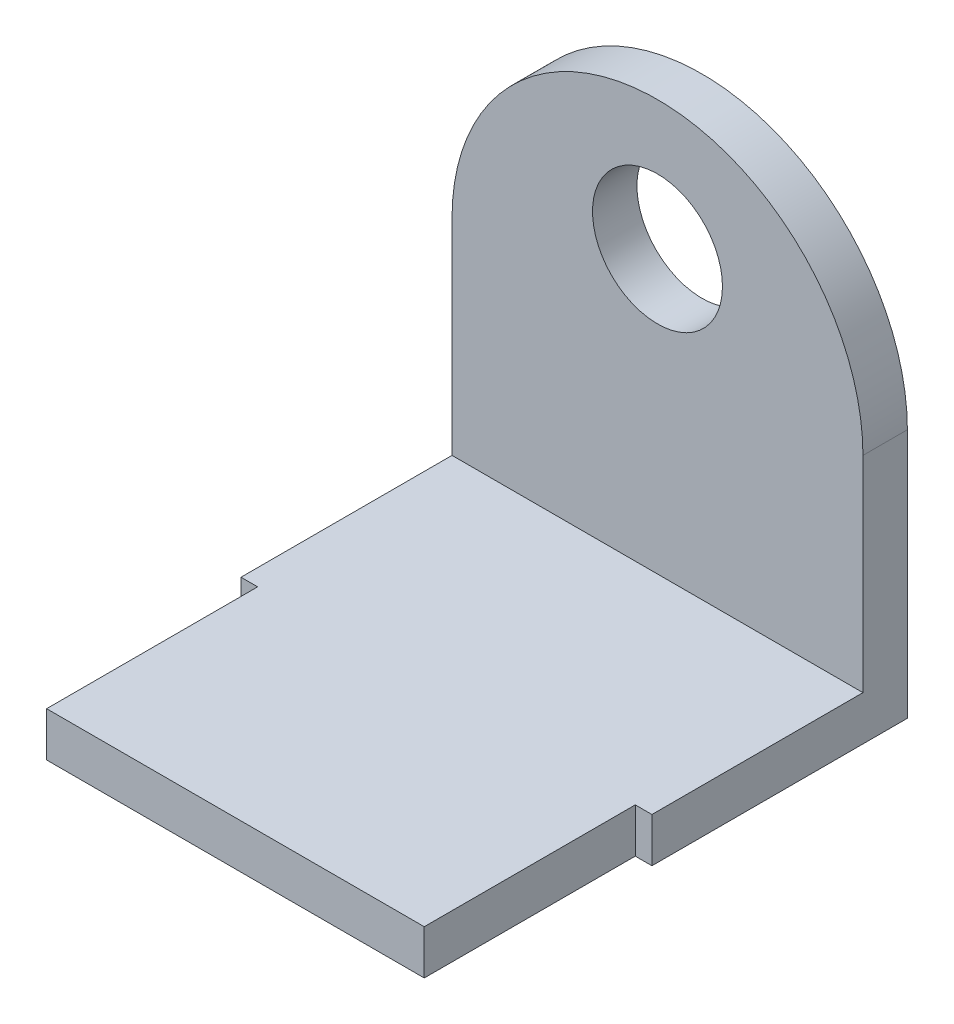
ISO-10303-21;
HEADER;
FILE_DESCRIPTION(('STEP AP214'),'2;1');
FILE_NAME('part.step','',(''),(''),'','','');
FILE_SCHEMA(('AUTOMOTIVE_DESIGN { 1 0 10303 214 1 1 1 1 }'));
ENDSEC;
DATA;
#1=APPLICATION_CONTEXT('core data for automotive mechanical design processes');
#2=APPLICATION_PROTOCOL_DEFINITION('international standard','automotive_design',2000,#1);
#3=PRODUCT_CONTEXT('',#1,'mechanical');
#4=PRODUCT('Part','Part','',(#3));
#5=PRODUCT_RELATED_PRODUCT_CATEGORY('part','',(#4));
#6=PRODUCT_DEFINITION_FORMATION('','',#4);
#7=PRODUCT_DEFINITION_CONTEXT('part definition',#1,'design');
#8=PRODUCT_DEFINITION('design','',#6,#7);
#9=PRODUCT_DEFINITION_SHAPE('','',#8);
#10=(LENGTH_UNIT() NAMED_UNIT(*) SI_UNIT(.MILLI.,.METRE.));
#11=(NAMED_UNIT(*) PLANE_ANGLE_UNIT() SI_UNIT($,.RADIAN.));
#12=(NAMED_UNIT(*) SI_UNIT($,.STERADIAN.) SOLID_ANGLE_UNIT());
#13=UNCERTAINTY_MEASURE_WITH_UNIT(LENGTH_MEASURE(1.E-05),#10,'distance_accuracy_value','');
#14=(GEOMETRIC_REPRESENTATION_CONTEXT(3) GLOBAL_UNCERTAINTY_ASSIGNED_CONTEXT((#13)) GLOBAL_UNIT_ASSIGNED_CONTEXT((#10,
#11,#12)) REPRESENTATION_CONTEXT('',''));
#15=CARTESIAN_POINT('',(0.,0.,0.));
#16=DIRECTION('',(0.,0.,1.));
#17=DIRECTION('',(1.,0.,0.));
#18=AXIS2_PLACEMENT_3D('',#15,#16,#17);
#19=CARTESIAN_POINT('',(-46.1103954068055,-22.5,4.));
#20=DIRECTION('',(0.,1.,0.));
#21=DIRECTION('',(-1.,0.,0.));
#22=AXIS2_PLACEMENT_3D('',#19,#20,#21);
#23=PLANE('',#22);
#24=DIRECTION('',(0.,0.,1.));
#25=VECTOR('',#24,1.);
#26=CARTESIAN_POINT('',(-44.6103954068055,-22.5,4.));
#27=LINE('',#26,#25);
#28=CARTESIAN_POINT('',(-44.6103954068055,-22.5,23.));
#29=VERTEX_POINT('',#28);
#30=CARTESIAN_POINT('',(-44.6103954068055,-22.5,42.));
#31=VERTEX_POINT('',#30);
#32=EDGE_CURVE('E47',#29,#31,#27,.T.);
#33=ORIENTED_EDGE('',*,*,#32,.F.);
#34=DIRECTION('',(-1.,0.,0.));
#35=VECTOR('',#34,1.);
#36=CARTESIAN_POINT('',(-46.1103954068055,-22.5,23.));
#37=LINE('',#36,#35);
#38=CARTESIAN_POINT('',(-46.1103954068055,-22.5,23.));
#39=VERTEX_POINT('',#38);
#40=EDGE_CURVE('E116',#29,#39,#37,.T.);
#41=ORIENTED_EDGE('',*,*,#40,.T.);
#42=DIRECTION('',(0.,0.,-1.));
#43=VECTOR('',#42,1.);
#44=CARTESIAN_POINT('',(-46.1103954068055,-22.5,4.));
#45=LINE('',#44,#43);
#46=CARTESIAN_POINT('',(-46.1103954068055,-22.5,0.));
#47=VERTEX_POINT('',#46);
#48=EDGE_CURVE('E188',#39,#47,#45,.T.);
#49=ORIENTED_EDGE('',*,*,#48,.T.);
#50=DIRECTION('',(1.,0.,0.));
#51=VECTOR('',#50,1.);
#52=CARTESIAN_POINT('',(-46.1103954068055,-22.5,0.));
#53=LINE('',#52,#51);
#54=CARTESIAN_POINT('',(-9.11039540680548,-22.5,0.));
#55=VERTEX_POINT('',#54);
#56=EDGE_CURVE('E180',#47,#55,#53,.T.);
#57=ORIENTED_EDGE('',*,*,#56,.T.);
#58=DIRECTION('',(0.,0.,-1.));
#59=VECTOR('',#58,1.);
#60=CARTESIAN_POINT('',(-9.11039540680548,-22.5,4.));
#61=LINE('',#60,#59);
#62=CARTESIAN_POINT('',(-9.11039540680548,-22.5,23.));
#63=VERTEX_POINT('',#62);
#64=EDGE_CURVE('E186',#63,#55,#61,.T.);
#65=ORIENTED_EDGE('',*,*,#64,.F.);
#66=DIRECTION('',(1.,0.,0.));
#67=VECTOR('',#66,1.);
#68=CARTESIAN_POINT('',(-46.1103954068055,-22.5,23.));
#69=LINE('',#68,#67);
#70=CARTESIAN_POINT('',(-10.6103954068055,-22.5,23.));
#71=VERTEX_POINT('',#70);
#72=EDGE_CURVE('E146',#71,#63,#69,.T.);
#73=ORIENTED_EDGE('',*,*,#72,.F.);
#74=DIRECTION('',(0.,0.,1.));
#75=VECTOR('',#74,1.);
#76=CARTESIAN_POINT('',(-10.6103954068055,-22.5,4.));
#77=LINE('',#76,#75);
#78=CARTESIAN_POINT('',(-10.6103954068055,-22.5,42.));
#79=VERTEX_POINT('',#78);
#80=EDGE_CURVE('E142',#71,#79,#77,.T.);
#81=ORIENTED_EDGE('',*,*,#80,.T.);
#82=DIRECTION('',(1.,0.,0.));
#83=VECTOR('',#82,1.);
#84=CARTESIAN_POINT('',(-46.1103954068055,-22.5,42.));
#85=LINE('',#84,#83);
#86=EDGE_CURVE('E148',#31,#79,#85,.T.);
#87=ORIENTED_EDGE('',*,*,#86,.F.);
#88=EDGE_LOOP('',(#33,#41,#49,#57,#65,#73,#81,#87));
#89=FACE_BOUND('',#88,.T.);
#90=ADVANCED_FACE('F33',(#89),#23,.F.);
#91=CARTESIAN_POINT('',(-46.1103954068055,-18.5,42.));
#92=DIRECTION('',(0.,-1.,0.));
#93=DIRECTION('',(0.,0.,-1.));
#94=AXIS2_PLACEMENT_3D('',#91,#92,#93);
#95=PLANE('',#94);
#96=DIRECTION('',(0.,0.,1.));
#97=VECTOR('',#96,1.);
#98=CARTESIAN_POINT('',(-44.6103954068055,-18.5,0.));
#99=LINE('',#98,#97);
#100=CARTESIAN_POINT('',(-44.6103954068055,-18.5,23.));
#101=VERTEX_POINT('',#100);
#102=CARTESIAN_POINT('',(-44.6103954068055,-18.5,42.));
#103=VERTEX_POINT('',#102);
#104=EDGE_CURVE('E120',#101,#103,#99,.T.);
#105=ORIENTED_EDGE('',*,*,#104,.T.);
#106=DIRECTION('',(-1.,0.,0.));
#107=VECTOR('',#106,1.);
#108=CARTESIAN_POINT('',(-46.1103954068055,-18.5,42.));
#109=LINE('',#108,#107);
#110=CARTESIAN_POINT('',(-10.6103954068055,-18.5,42.));
#111=VERTEX_POINT('',#110);
#112=EDGE_CURVE('E150',#111,#103,#109,.T.);
#113=ORIENTED_EDGE('',*,*,#112,.F.);
#114=DIRECTION('',(0.,0.,1.));
#115=VECTOR('',#114,1.);
#116=CARTESIAN_POINT('',(-10.6103954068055,-18.5,0.));
#117=LINE('',#116,#115);
#118=CARTESIAN_POINT('',(-10.6103954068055,-18.5,23.));
#119=VERTEX_POINT('',#118);
#120=EDGE_CURVE('E55',#119,#111,#117,.T.);
#121=ORIENTED_EDGE('',*,*,#120,.F.);
#122=DIRECTION('',(1.,0.,0.));
#123=VECTOR('',#122,1.);
#124=CARTESIAN_POINT('',(0.,-18.5,23.));
#125=LINE('',#124,#123);
#126=CARTESIAN_POINT('',(-9.11039540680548,-18.5,23.));
#127=VERTEX_POINT('',#126);
#128=EDGE_CURVE('E135',#119,#127,#125,.T.);
#129=ORIENTED_EDGE('',*,*,#128,.T.);
#130=DIRECTION('',(0.,0.,-1.));
#131=VECTOR('',#130,1.);
#132=CARTESIAN_POINT('',(-9.11039540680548,-18.5,42.));
#133=LINE('',#132,#131);
#134=CARTESIAN_POINT('',(-9.11039540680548,-18.5,4.));
#135=VERTEX_POINT('',#134);
#136=EDGE_CURVE('E153',#127,#135,#133,.T.);
#137=ORIENTED_EDGE('',*,*,#136,.T.);
#138=DIRECTION('',(1.,0.,0.));
#139=VECTOR('',#138,1.);
#140=CARTESIAN_POINT('',(-27.6103954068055,-18.5,4.));
#141=LINE('',#140,#139);
#142=CARTESIAN_POINT('',(-46.1103954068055,-18.5,4.00000000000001));
#143=VERTEX_POINT('',#142);
#144=EDGE_CURVE('E155',#143,#135,#141,.T.);
#145=ORIENTED_EDGE('',*,*,#144,.F.);
#146=DIRECTION('',(0.,0.,-1.));
#147=VECTOR('',#146,1.);
#148=CARTESIAN_POINT('',(-46.1103954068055,-18.5,42.));
#149=LINE('',#148,#147);
#150=CARTESIAN_POINT('',(-46.1103954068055,-18.5,23.));
#151=VERTEX_POINT('',#150);
#152=EDGE_CURVE('E129',#151,#143,#149,.T.);
#153=ORIENTED_EDGE('',*,*,#152,.F.);
#154=DIRECTION('',(-1.,0.,0.));
#155=VECTOR('',#154,1.);
#156=CARTESIAN_POINT('',(0.,-18.5,22.9999999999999));
#157=LINE('',#156,#155);
#158=EDGE_CURVE('E113',#101,#151,#157,.T.);
#159=ORIENTED_EDGE('',*,*,#158,.F.);
#160=EDGE_LOOP('',(#105,#113,#121,#129,#137,#145,#153,#159));
#161=FACE_BOUND('',#160,.T.);
#162=ADVANCED_FACE('F127',(#161),#95,.F.);
#163=CARTESIAN_POINT('',(0.,0.,42.));
#164=DIRECTION('',(0.,0.,-1.));
#165=DIRECTION('',(-1.,0.,0.));
#166=AXIS2_PLACEMENT_3D('',#163,#164,#165);
#167=PLANE('',#166);
#168=DIRECTION('',(0.,1.,0.));
#169=VECTOR('',#168,1.);
#170=CARTESIAN_POINT('',(-44.6103954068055,0.,42.));
#171=LINE('',#170,#169);
#172=EDGE_CURVE('E11',#31,#103,#171,.T.);
#173=ORIENTED_EDGE('',*,*,#172,.F.);
#174=ORIENTED_EDGE('',*,*,#86,.T.);
#175=DIRECTION('',(0.,1.,0.));
#176=VECTOR('',#175,1.);
#177=CARTESIAN_POINT('',(-10.6103954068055,0.,42.));
#178=LINE('',#177,#176);
#179=EDGE_CURVE('E41',#79,#111,#178,.T.);
#180=ORIENTED_EDGE('',*,*,#179,.T.);
#181=ORIENTED_EDGE('',*,*,#112,.T.);
#182=EDGE_LOOP('',(#173,#174,#180,#181));
#183=FACE_BOUND('',#182,.T.);
#184=ADVANCED_FACE('F193',(#183),#167,.F.);
#185=CARTESIAN_POINT('',(-9.11039540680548,0.,4.));
#186=DIRECTION('',(-1.,0.,0.));
#187=DIRECTION('',(0.,-1.,0.));
#188=AXIS2_PLACEMENT_3D('',#185,#186,#187);
#189=PLANE('',#188);
#190=DIRECTION('',(0.,1.,0.));
#191=VECTOR('',#190,1.);
#192=CARTESIAN_POINT('',(-9.11039540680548,-28.5,23.));
#193=LINE('',#192,#191);
#194=EDGE_CURVE('E140',#63,#127,#193,.T.);
#195=ORIENTED_EDGE('',*,*,#194,.F.);
#196=ORIENTED_EDGE('',*,*,#64,.T.);
#197=DIRECTION('',(0.,1.,0.));
#198=VECTOR('',#197,1.);
#199=CARTESIAN_POINT('',(-9.11039540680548,0.,0.));
#200=LINE('',#199,#198);
#201=CARTESIAN_POINT('',(-9.11039540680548,0.,0.));
#202=VERTEX_POINT('',#201);
#203=EDGE_CURVE('E169',#55,#202,#200,.T.);
#204=ORIENTED_EDGE('',*,*,#203,.T.);
#205=DIRECTION('',(0.,0.,-1.));
#206=VECTOR('',#205,1.);
#207=CARTESIAN_POINT('',(-9.11039540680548,0.,4.));
#208=LINE('',#207,#206);
#209=CARTESIAN_POINT('',(-9.11039540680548,0.,4.));
#210=VERTEX_POINT('',#209);
#211=EDGE_CURVE('E174',#210,#202,#208,.T.);
#212=ORIENTED_EDGE('',*,*,#211,.F.);
#213=DIRECTION('',(0.,1.,0.));
#214=VECTOR('',#213,1.);
#215=CARTESIAN_POINT('',(-9.11039540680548,0.,4.));
#216=LINE('',#215,#214);
#217=EDGE_CURVE('E172',#135,#210,#216,.T.);
#218=ORIENTED_EDGE('',*,*,#217,.F.);
#219=ORIENTED_EDGE('',*,*,#136,.F.);
#220=EDGE_LOOP('',(#195,#196,#204,#212,#218,#219));
#221=FACE_BOUND('',#220,.T.);
#222=ADVANCED_FACE('F202',(#221),#189,.F.);
#223=CARTESIAN_POINT('',(-27.6103954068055,0.,4.));
#224=DIRECTION('',(0.,0.,1.));
#225=DIRECTION('',(1.,0.,0.));
#226=AXIS2_PLACEMENT_3D('',#223,#224,#225);
#227=PLANE('',#226);
#228=CARTESIAN_POINT('',(-27.6103954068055,6.85,4.));
#229=DIRECTION('',(0.,0.,1.));
#230=DIRECTION('',(1.,0.,0.));
#231=AXIS2_PLACEMENT_3D('',#228,#229,#230);
#232=CIRCLE('',#231,5.85);
#233=CARTESIAN_POINT('',(-21.7603954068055,6.85,4.));
#234=VERTEX_POINT('',#233);
#235=EDGE_CURVE('E159',#234,#234,#232,.T.);
#236=ORIENTED_EDGE('',*,*,#235,.F.);
#237=EDGE_LOOP('',(#236));
#238=FACE_BOUND('',#237,.T.);
#239=DIRECTION('',(0.,-1.,0.));
#240=VECTOR('',#239,1.);
#241=CARTESIAN_POINT('',(-46.1103954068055,0.,4.));
#242=LINE('',#241,#240);
#243=CARTESIAN_POINT('',(-46.1103954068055,0.,4.));
#244=VERTEX_POINT('',#243);
#245=EDGE_CURVE('E168',#244,#143,#242,.T.);
#246=ORIENTED_EDGE('',*,*,#245,.T.);
#247=ORIENTED_EDGE('',*,*,#144,.T.);
#248=ORIENTED_EDGE('',*,*,#217,.T.);
#249=CARTESIAN_POINT('',(-27.6103954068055,0.,4.));
#250=DIRECTION('',(0.,0.,1.));
#251=DIRECTION('',(1.,0.,0.));
#252=AXIS2_PLACEMENT_3D('',#249,#250,#251);
#253=CIRCLE('',#252,18.5);
#254=EDGE_CURVE('E165',#210,#244,#253,.T.);
#255=ORIENTED_EDGE('',*,*,#254,.T.);
#256=EDGE_LOOP('',(#246,#247,#248,#255));
#257=FACE_BOUND('',#256,.T.);
#258=ADVANCED_FACE('F207',(#238,#257),#227,.T.);
#259=CARTESIAN_POINT('',(-27.6103954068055,0.,0.));
#260=DIRECTION('',(0.,0.,1.));
#261=DIRECTION('',(1.,0.,0.));
#262=AXIS2_PLACEMENT_3D('',#259,#260,#261);
#263=PLANE('',#262);
#264=ORIENTED_EDGE('',*,*,#56,.F.);
#265=DIRECTION('',(0.,-1.,0.));
#266=VECTOR('',#265,1.);
#267=CARTESIAN_POINT('',(-46.1103954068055,0.,0.));
#268=LINE('',#267,#266);
#269=CARTESIAN_POINT('',(-46.1103954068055,0.,0.));
#270=VERTEX_POINT('',#269);
#271=EDGE_CURVE('E177',#270,#47,#268,.T.);
#272=ORIENTED_EDGE('',*,*,#271,.F.);
#273=CARTESIAN_POINT('',(-27.6103954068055,0.,0.));
#274=DIRECTION('',(0.,0.,1.));
#275=DIRECTION('',(1.,0.,0.));
#276=AXIS2_PLACEMENT_3D('',#273,#274,#275);
#277=CIRCLE('',#276,18.5);
#278=EDGE_CURVE('E162',#202,#270,#277,.T.);
#279=ORIENTED_EDGE('',*,*,#278,.F.);
#280=ORIENTED_EDGE('',*,*,#203,.F.);
#281=EDGE_LOOP('',(#264,#272,#279,#280));
#282=FACE_BOUND('',#281,.T.);
#283=CARTESIAN_POINT('',(-27.6103954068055,6.85,0.));
#284=DIRECTION('',(0.,0.,1.));
#285=DIRECTION('',(1.,0.,0.));
#286=AXIS2_PLACEMENT_3D('',#283,#284,#285);
#287=CIRCLE('',#286,5.85);
#288=CARTESIAN_POINT('',(-21.7603954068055,6.85,0.));
#289=VERTEX_POINT('',#288);
#290=EDGE_CURVE('E158',#289,#289,#287,.T.);
#291=ORIENTED_EDGE('',*,*,#290,.T.);
#292=EDGE_LOOP('',(#291));
#293=FACE_BOUND('',#292,.T.);
#294=ADVANCED_FACE('F241',(#282,#293),#263,.F.);
#295=CARTESIAN_POINT('',(-27.6103954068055,0.,4.));
#296=DIRECTION('',(0.,0.,-1.));
#297=DIRECTION('',(-1.,0.,0.));
#298=AXIS2_PLACEMENT_3D('',#295,#296,#297);
#299=CYLINDRICAL_SURFACE('',#298,18.5);
#300=ORIENTED_EDGE('',*,*,#278,.T.);
#301=DIRECTION('',(0.,0.,-1.));
#302=VECTOR('',#301,1.);
#303=CARTESIAN_POINT('',(-46.1103954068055,0.,4.));
#304=LINE('',#303,#302);
#305=EDGE_CURVE('E190',#244,#270,#304,.T.);
#306=ORIENTED_EDGE('',*,*,#305,.F.);
#307=ORIENTED_EDGE('',*,*,#254,.F.);
#308=ORIENTED_EDGE('',*,*,#211,.T.);
#309=EDGE_LOOP('',(#300,#306,#307,#308));
#310=FACE_BOUND('',#309,.T.);
#311=ADVANCED_FACE('F35',(#310),#299,.T.);
#312=CARTESIAN_POINT('',(-46.1103954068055,0.,4.));
#313=DIRECTION('',(1.,0.,0.));
#314=DIRECTION('',(0.,0.,-1.));
#315=AXIS2_PLACEMENT_3D('',#312,#313,#314);
#316=PLANE('',#315);
#317=ORIENTED_EDGE('',*,*,#48,.F.);
#318=DIRECTION('',(0.,1.,0.));
#319=VECTOR('',#318,1.);
#320=CARTESIAN_POINT('',(-46.1103954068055,-28.5,23.));
#321=LINE('',#320,#319);
#322=EDGE_CURVE('E117',#39,#151,#321,.T.);
#323=ORIENTED_EDGE('',*,*,#322,.T.);
#324=ORIENTED_EDGE('',*,*,#152,.T.);
#325=ORIENTED_EDGE('',*,*,#245,.F.);
#326=ORIENTED_EDGE('',*,*,#305,.T.);
#327=ORIENTED_EDGE('',*,*,#271,.T.);
#328=EDGE_LOOP('',(#317,#323,#324,#325,#326,#327));
#329=FACE_BOUND('',#328,.T.);
#330=ADVANCED_FACE('F211',(#329),#316,.F.);
#331=CARTESIAN_POINT('',(-27.6103954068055,6.85,4.));
#332=DIRECTION('',(0.,0.,-1.));
#333=DIRECTION('',(-1.,0.,0.));
#334=AXIS2_PLACEMENT_3D('',#331,#332,#333);
#335=CYLINDRICAL_SURFACE('',#334,5.85);
#336=ORIENTED_EDGE('',*,*,#235,.T.);
#337=EDGE_LOOP('',(#336));
#338=FACE_BOUND('',#337,.T.);
#339=ORIENTED_EDGE('',*,*,#290,.F.);
#340=EDGE_LOOP('',(#339));
#341=FACE_BOUND('',#340,.T.);
#342=ADVANCED_FACE('F217',(#338,#341),#335,.F.);
#343=CARTESIAN_POINT('',(0.,-28.5,23.));
#344=DIRECTION('',(0.,0.,1.));
#345=DIRECTION('',(1.,0.,0.));
#346=AXIS2_PLACEMENT_3D('',#343,#344,#345);
#347=PLANE('',#346);
#348=ORIENTED_EDGE('',*,*,#72,.T.);
#349=ORIENTED_EDGE('',*,*,#194,.T.);
#350=ORIENTED_EDGE('',*,*,#128,.F.);
#351=DIRECTION('',(0.,1.,0.));
#352=VECTOR('',#351,1.);
#353=CARTESIAN_POINT('',(-10.6103954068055,-28.5,23.));
#354=LINE('',#353,#352);
#355=EDGE_CURVE('E139',#71,#119,#354,.T.);
#356=ORIENTED_EDGE('',*,*,#355,.F.);
#357=EDGE_LOOP('',(#348,#349,#350,#356));
#358=FACE_BOUND('',#357,.T.);
#359=ADVANCED_FACE('F215',(#358),#347,.T.);
#360=CARTESIAN_POINT('',(-10.6103954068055,-28.5,0.));
#361=DIRECTION('',(-1.,0.,0.));
#362=DIRECTION('',(0.,0.,1.));
#363=AXIS2_PLACEMENT_3D('',#360,#361,#362);
#364=PLANE('',#363);
#365=ORIENTED_EDGE('',*,*,#355,.T.);
#366=ORIENTED_EDGE('',*,*,#120,.T.);
#367=ORIENTED_EDGE('',*,*,#179,.F.);
#368=ORIENTED_EDGE('',*,*,#80,.F.);
#369=EDGE_LOOP('',(#365,#366,#367,#368));
#370=FACE_BOUND('',#369,.T.);
#371=ADVANCED_FACE('F214',(#370),#364,.F.);
#372=CARTESIAN_POINT('',(0.,-28.5,22.9999999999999));
#373=DIRECTION('',(0.,0.,-1.));
#374=DIRECTION('',(-1.,0.,0.));
#375=AXIS2_PLACEMENT_3D('',#372,#373,#374);
#376=PLANE('',#375);
#377=DIRECTION('',(0.,1.,0.));
#378=VECTOR('',#377,1.);
#379=CARTESIAN_POINT('',(-44.6103954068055,-28.5,23.));
#380=LINE('',#379,#378);
#381=EDGE_CURVE('E109',#29,#101,#380,.T.);
#382=ORIENTED_EDGE('',*,*,#381,.T.);
#383=ORIENTED_EDGE('',*,*,#158,.T.);
#384=ORIENTED_EDGE('',*,*,#322,.F.);
#385=ORIENTED_EDGE('',*,*,#40,.F.);
#386=EDGE_LOOP('',(#382,#383,#384,#385));
#387=FACE_BOUND('',#386,.T.);
#388=ADVANCED_FACE('F111',(#387),#376,.F.);
#389=CARTESIAN_POINT('',(-44.6103954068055,-28.5,0.));
#390=DIRECTION('',(-1.,0.,0.));
#391=DIRECTION('',(0.,0.,1.));
#392=AXIS2_PLACEMENT_3D('',#389,#390,#391);
#393=PLANE('',#392);
#394=ORIENTED_EDGE('',*,*,#32,.T.);
#395=ORIENTED_EDGE('',*,*,#172,.T.);
#396=ORIENTED_EDGE('',*,*,#104,.F.);
#397=ORIENTED_EDGE('',*,*,#381,.F.);
#398=EDGE_LOOP('',(#394,#395,#396,#397));
#399=FACE_BOUND('',#398,.T.);
#400=ADVANCED_FACE('F121',(#399),#393,.T.);
#401=CLOSED_SHELL('',(#90,#162,#184,#222,#258,#294,#311,#330,#342,#359,#371,#388,#400));
#402=MANIFOLD_SOLID_BREP('B2',#401);
#403=ADVANCED_BREP_SHAPE_REPRESENTATION('',(#18,#402),#14);
#404=SHAPE_DEFINITION_REPRESENTATION(#9,#403);
ENDSEC;
END-ISO-10303-21;
